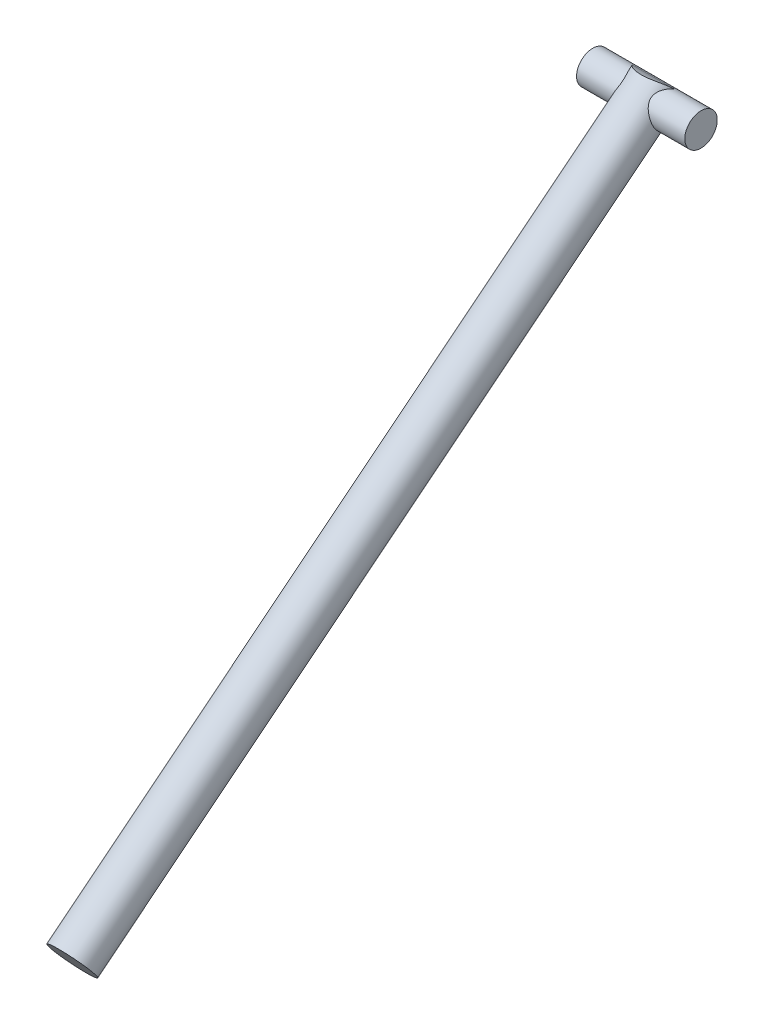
ISO-10303-21;
HEADER;
FILE_DESCRIPTION(('STEP AP214'),'2;1');
FILE_NAME('part.step','',(''),(''),'','','');
FILE_SCHEMA(('AUTOMOTIVE_DESIGN { 1 0 10303 214 1 1 1 1 }'));
ENDSEC;
DATA;
#1=APPLICATION_CONTEXT('core data for automotive mechanical design processes');
#2=APPLICATION_PROTOCOL_DEFINITION('international standard','automotive_design',2000,#1);
#3=PRODUCT_CONTEXT('',#1,'mechanical');
#4=PRODUCT('Part','Part','',(#3));
#5=PRODUCT_RELATED_PRODUCT_CATEGORY('part','',(#4));
#6=PRODUCT_DEFINITION_FORMATION('','',#4);
#7=PRODUCT_DEFINITION_CONTEXT('part definition',#1,'design');
#8=PRODUCT_DEFINITION('design','',#6,#7);
#9=PRODUCT_DEFINITION_SHAPE('','',#8);
#10=(LENGTH_UNIT() NAMED_UNIT(*) SI_UNIT(.MILLI.,.METRE.));
#11=(NAMED_UNIT(*) PLANE_ANGLE_UNIT() SI_UNIT($,.RADIAN.));
#12=(NAMED_UNIT(*) SI_UNIT($,.STERADIAN.) SOLID_ANGLE_UNIT());
#13=UNCERTAINTY_MEASURE_WITH_UNIT(LENGTH_MEASURE(1.E-05),#10,'distance_accuracy_value','');
#14=(GEOMETRIC_REPRESENTATION_CONTEXT(3) GLOBAL_UNCERTAINTY_ASSIGNED_CONTEXT((#13)) GLOBAL_UNIT_ASSIGNED_CONTEXT((#10,
#11,#12)) REPRESENTATION_CONTEXT('',''));
#15=CARTESIAN_POINT('',(0.,0.,0.));
#16=DIRECTION('',(0.,0.,1.));
#17=DIRECTION('',(1.,0.,0.));
#18=AXIS2_PLACEMENT_3D('',#15,#16,#17);
#19=CARTESIAN_POINT('',(13.5886120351,0.,0.));
#20=DIRECTION('',(1.,0.,0.));
#21=DIRECTION('',(0.,0.,-1.));
#22=AXIS2_PLACEMENT_3D('',#19,#20,#21);
#23=PLANE('',#22);
#24=CARTESIAN_POINT('',(13.5886120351,-151.390158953,1385.21245248));
#25=DIRECTION('',(1.,0.,0.));
#26=DIRECTION('',(0.,0.,-1.));
#27=AXIS2_PLACEMENT_3D('',#24,#25,#26);
#28=CIRCLE('',#27,7.49999999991);
#29=CARTESIAN_POINT('',(13.5886120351,-151.390158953,1377.71245248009));
#30=VERTEX_POINT('',#29);
#31=EDGE_CURVE('E59',#30,#30,#28,.T.);
#32=ORIENTED_EDGE('',*,*,#31,.F.);
#33=EDGE_LOOP('',(#32));
#34=FACE_BOUND('',#33,.T.);
#35=ADVANCED_FACE('F16',(#34),#23,.F.);
#36=CARTESIAN_POINT('',(-102.895065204,-160.923012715,1397.12673248));
#37=DIRECTION('',(1.,0.,0.));
#38=DIRECTION('',(0.,0.,-1.));
#39=AXIS2_PLACEMENT_3D('',#36,#37,#38);
#40=CYLINDRICAL_SURFACE('',#39,22.2586162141);
#41=DIRECTION('',(1.,0.,0.));
#42=VECTOR('',#41,1.);
#43=CARTESIAN_POINT('',(38.5886120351,-144.632807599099,1381.9585006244));
#44=LINE('',#43,#42);
#45=CARTESIAN_POINT('',(29.1292002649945,-144.632808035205,1381.95850089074));
#46=VERTEX_POINT('',#45);
#47=CARTESIAN_POINT('',(48.0480227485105,-144.63280622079,1381.95850355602));
#48=VERTEX_POINT('',#47);
#49=EDGE_CURVE('E52',#46,#48,#44,.T.);
#50=ORIENTED_EDGE('',*,*,#49,.F.);
#51=CARTESIAN_POINT('',(48.0480226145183,-144.632806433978,1381.95850359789));
#52=CARTESIAN_POINT('',(47.9556910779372,-144.447239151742,1382.15774454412));
#53=CARTESIAN_POINT('',(47.8520261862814,-144.268045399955,1382.3575746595));
#54=CARTESIAN_POINT('',(47.6232211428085,-143.922927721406,1382.75620194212));
#55=CARTESIAN_POINT('',(47.498091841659,-143.756997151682,1382.95499957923));
#56=CARTESIAN_POINT('',(47.2277618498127,-143.439102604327,1383.34910700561));
#57=CARTESIAN_POINT('',(47.0826074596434,-143.287107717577,1383.54442369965));
#58=CARTESIAN_POINT('',(46.7731590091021,-142.99675971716,1383.93000278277));
#59=CARTESIAN_POINT('',(46.6088626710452,-142.858408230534,1384.12026456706));
#60=CARTESIAN_POINT('',(46.262599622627,-142.595554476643,1384.49335339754));
#61=CARTESIAN_POINT('',(46.0806646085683,-142.471028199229,1384.67619297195));
#62=CARTESIAN_POINT('',(45.6999381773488,-142.235324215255,1385.03284957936));
#63=CARTESIAN_POINT('',(45.5011410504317,-142.124151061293,1385.20666352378));
#64=CARTESIAN_POINT('',(45.087713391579,-141.914872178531,1385.54330023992));
#65=CARTESIAN_POINT('',(44.8730723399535,-141.816775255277,1385.70611556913));
#66=CARTESIAN_POINT('',(44.429195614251,-141.63343160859,1386.01858778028));
#67=CARTESIAN_POINT('',(44.1999592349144,-141.548185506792,1386.16824402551));
#68=CARTESIAN_POINT('',(43.7198778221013,-141.387490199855,1386.45725986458));
#69=CARTESIAN_POINT('',(43.4685584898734,-141.312484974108,1386.59608014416));
#70=CARTESIAN_POINT('',(42.9531614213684,-141.175619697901,1386.8550278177));
#71=CARTESIAN_POINT('',(42.6890891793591,-141.113754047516,1386.97516316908));
#72=CARTESIAN_POINT('',(42.1499237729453,-141.002878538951,1387.19449420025));
#73=CARTESIAN_POINT('',(41.8748363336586,-140.953862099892,1387.29370059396));
#74=CARTESIAN_POINT('',(41.3155265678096,-140.868426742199,1387.46913860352));
#75=CARTESIAN_POINT('',(41.0313051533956,-140.832006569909,1387.54537250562));
#76=CARTESIAN_POINT('',(40.4753424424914,-140.773624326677,1387.66880009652));
#77=CARTESIAN_POINT('',(40.204041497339,-140.750856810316,1387.71759774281));
#78=CARTESIAN_POINT('',(39.6576450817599,-140.716058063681,1387.79256404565));
#79=CARTESIAN_POINT('',(39.3825497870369,-140.704026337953,1387.81873374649));
#80=CARTESIAN_POINT('',(38.8309879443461,-140.690657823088,1387.84782795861));
#81=CARTESIAN_POINT('',(38.5545220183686,-140.689316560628,1387.85076219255));
#82=CARTESIAN_POINT('',(38.0024887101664,-140.697312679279,1387.83333974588));
#83=CARTESIAN_POINT('',(37.7269212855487,-140.706649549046,1387.81298418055));
#84=CARTESIAN_POINT('',(37.2019839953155,-140.734801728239,1387.75213190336));
#85=CARTESIAN_POINT('',(36.9523528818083,-140.752757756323,1387.71346472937));
#86=CARTESIAN_POINT('',(36.457394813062,-140.797723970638,1387.61770806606));
#87=CARTESIAN_POINT('',(36.2120693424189,-140.824737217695,1387.56061234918));
#88=CARTESIAN_POINT('',(35.7274042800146,-140.887894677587,1387.42903402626));
#89=CARTESIAN_POINT('',(35.4880633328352,-140.924036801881,1387.35455539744));
#90=CARTESIAN_POINT('',(35.0165754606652,-141.005587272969,1387.18939698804));
#91=CARTESIAN_POINT('',(34.7844312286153,-141.050999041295,1387.09871122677));
#92=CARTESIAN_POINT('',(34.3197625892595,-141.153176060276,1386.89870023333));
#93=CARTESIAN_POINT('',(34.0875726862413,-141.210313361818,1386.78878845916));
#94=CARTESIAN_POINT('',(33.6333867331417,-141.334966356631,1386.5545026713));
#95=CARTESIAN_POINT('',(33.4113951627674,-141.402486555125,1386.43012238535));
#96=CARTESIAN_POINT('',(32.9786253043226,-141.548148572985,1386.16849100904));
#97=CARTESIAN_POINT('',(32.7678523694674,-141.626295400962,1386.03123385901));
#98=CARTESIAN_POINT('',(32.3585557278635,-141.793426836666,1385.74550522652));
#99=CARTESIAN_POINT('',(32.160032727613,-141.882412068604,1385.59703309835));
#100=CARTESIAN_POINT('',(31.7569951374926,-142.080874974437,1385.27519078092));
#101=CARTESIAN_POINT('',(31.5538522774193,-142.191510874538,1385.10081348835));
#102=CARTESIAN_POINT('',(31.1646646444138,-142.426408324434,1384.74256975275));
#103=CARTESIAN_POINT('',(30.9786145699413,-142.550665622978,1384.5587062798));
#104=CARTESIAN_POINT('',(30.6248661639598,-142.812906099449,1384.18369138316));
#105=CARTESIAN_POINT('',(30.4571497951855,-142.950875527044,1383.99254737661));
#106=CARTESIAN_POINT('',(30.1410978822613,-143.240646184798,1383.60495487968));
#107=CARTESIAN_POINT('',(29.9927547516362,-143.392441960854,1383.40850850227));
#108=CARTESIAN_POINT('',(29.7104974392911,-143.716791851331,1383.00363103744));
#109=CARTESIAN_POINT('',(29.5775023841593,-143.889964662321,1382.79505237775));
#110=CARTESIAN_POINT('',(29.3352638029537,-144.250698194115,1382.3769319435));
#111=CARTESIAN_POINT('',(29.2260003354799,-144.438246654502,1382.16739112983));
#112=CARTESIAN_POINT('',(29.1292002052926,-144.632808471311,1381.95850115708));
#113=B_SPLINE_CURVE_WITH_KNOTS('',3,(#51,#52,#53,#54,#55,#56,#57,#58,#59,#60,#61,#62,#63,#64,
#65,#66,#67,#68,#69,#70,#71,#72,#73,#74,#75,#76,#77,#78,#79,#80,#81,#82,#83,#84,#85,#86,#87,#88,
#89,#90,#91,#92,#93,#94,#95,#96,#97,#98,#99,#100,#101,#102,#103,#104,#105,#106,#107,#108,#109,
#110,#111,#112),.UNSPECIFIED.,.F.,.F.,(4,2,2,2,2,2,2,2,2,2,2,2,2,2,2,2,2,2,2,2,2,2,2,2,2,2,2,2,
2,2,4),(0.,0.862119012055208,1.72380348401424,2.5835280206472,3.44335495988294,4.3016644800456,
5.16026580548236,6.0194424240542,6.8786605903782,7.76776922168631,8.65649816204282,
9.54477103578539,10.4329554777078,11.2616090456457,12.090224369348,12.9184929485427,
13.7467218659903,14.505588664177,15.2647121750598,16.0236621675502,16.7828928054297,
17.5715719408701,18.3605942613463,19.1499897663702,19.9394307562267,20.8074791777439,
21.6752574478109,22.5421741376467,23.4087503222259,24.3133631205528,25.2172128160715),.UNSPECIFIED.);
#114=EDGE_CURVE('E19',#48,#46,#113,.T.);
#115=ORIENTED_EDGE('',*,*,#114,.F.);
#116=EDGE_LOOP('',(#50,#115));
#117=FACE_BOUND('',#116,.T.);
#118=ADVANCED_FACE('F57',(#117),#40,.T.);
#119=CARTESIAN_POINT('',(63.5886120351,0.,0.));
#120=DIRECTION('',(1.,0.,0.));
#121=DIRECTION('',(0.,0.,-1.));
#122=AXIS2_PLACEMENT_3D('',#119,#120,#121);
#123=PLANE('',#122);
#124=CARTESIAN_POINT('',(63.5886120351,-151.390158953,1385.21245248));
#125=DIRECTION('',(1.,0.,0.));
#126=DIRECTION('',(0.,0.,-1.));
#127=AXIS2_PLACEMENT_3D('',#124,#125,#126);
#128=CIRCLE('',#127,7.49999999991);
#129=CARTESIAN_POINT('',(63.5886120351,-151.390158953,1377.71245248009));
#130=VERTEX_POINT('',#129);
#131=EDGE_CURVE('E58',#130,#130,#128,.F.);
#132=ORIENTED_EDGE('',*,*,#131,.F.);
#133=EDGE_LOOP('',(#132));
#134=FACE_BOUND('',#133,.T.);
#135=ADVANCED_FACE('F91',(#134),#123,.T.);
#136=CARTESIAN_POINT('',(0.,-947.241267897,1183.87399765));
#137=DIRECTION('',(0.,-0.624752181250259,0.780823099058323));
#138=DIRECTION('',(0.,-0.780823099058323,-0.624752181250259));
#139=AXIS2_PLACEMENT_3D('',#136,#137,#138);
#140=PLANE('',#139);
#141=CARTESIAN_POINT('',(38.5886120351,-363.805900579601,1650.69230615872));
#142=DIRECTION('',(0.,-0.624752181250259,0.780823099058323));
#143=DIRECTION('',(0.,-0.780823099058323,-0.624752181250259));
#144=AXIS2_PLACEMENT_3D('',#141,#142,#143);
#145=CIRCLE('',#144,10.);
#146=CARTESIAN_POINT('',(38.5886120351,-371.614131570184,1644.44478434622));
#147=VERTEX_POINT('',#146);
#148=EDGE_CURVE('E53',#147,#147,#145,.F.);
#149=ORIENTED_EDGE('',*,*,#148,.F.);
#150=EDGE_LOOP('',(#149));
#151=FACE_BOUND('',#150,.T.);
#152=ADVANCED_FACE('F88',(#151),#140,.T.);
#153=CARTESIAN_POINT('',(-102.895065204,-160.923012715,1397.12673248));
#154=DIRECTION('',(1.,0.,0.));
#155=DIRECTION('',(0.,0.,-1.));
#156=AXIS2_PLACEMENT_3D('',#153,#154,#155);
#157=CYLINDRICAL_SURFACE('',#156,22.2586162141);
#158=DIRECTION('',(1.,0.,0.));
#159=VECTOR('',#158,1.);
#160=CARTESIAN_POINT('',(38.5886120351,-149.697824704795,1377.90587976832));
#161=LINE('',#160,#159);
#162=CARTESIAN_POINT('',(48.0480233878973,-149.697824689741,1377.90587977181));
#163=VERTEX_POINT('',#162);
#164=CARTESIAN_POINT('',(29.1292011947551,-149.697826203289,1377.90587927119));
#165=VERTEX_POINT('',#164);
#166=EDGE_CURVE('E37',#163,#165,#161,.F.);
#167=ORIENTED_EDGE('',*,*,#166,.F.);
#168=CARTESIAN_POINT('',(29.1292019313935,-149.69782776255,1377.90587903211));
#169=CARTESIAN_POINT('',(29.2215334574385,-149.932923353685,1377.76853915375));
#170=CARTESIAN_POINT('',(29.325198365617,-150.167195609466,1377.63754683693));
#171=CARTESIAN_POINT('',(29.5540034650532,-150.631821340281,1377.38828223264));
#172=CARTESIAN_POINT('',(29.6791328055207,-150.862176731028,1377.27000356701));
#173=CARTESIAN_POINT('',(29.9494628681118,-151.316420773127,1377.04630749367));
#174=CARTESIAN_POINT('',(30.0946172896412,-151.540322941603,1376.94086144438));
#175=CARTESIAN_POINT('',(30.4040658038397,-151.980203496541,1376.74217007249));
#176=CARTESIAN_POINT('',(30.5683621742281,-152.196180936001,1376.64892620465));
#177=CARTESIAN_POINT('',(30.9146252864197,-152.617844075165,1376.4743193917));
#178=CARTESIAN_POINT('',(31.0965603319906,-152.82354726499,1376.39293576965));
#179=CARTESIAN_POINT('',(31.4772868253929,-153.223222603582,1376.2412126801));
#180=CARTESIAN_POINT('',(31.6760839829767,-153.417190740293,1376.17087697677));
#181=CARTESIAN_POINT('',(32.0895117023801,-153.791536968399,1376.04054356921));
#182=CARTESIAN_POINT('',(32.3041527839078,-153.971905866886,1375.9805528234));
#183=CARTESIAN_POINT('',(32.748029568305,-154.316986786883,1375.87022196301));
#184=CARTESIAN_POINT('',(32.9772659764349,-154.48169805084,1375.81988231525));
#185=CARTESIAN_POINT('',(33.4573474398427,-154.79892558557,1375.72650251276));
#186=CARTESIAN_POINT('',(33.7086667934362,-154.950818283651,1375.68377721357));
#187=CARTESIAN_POINT('',(34.224063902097,-155.233482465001,1375.60705094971));
#188=CARTESIAN_POINT('',(34.4881361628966,-155.364262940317,1375.57304626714));
#189=CARTESIAN_POINT('',(35.0273016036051,-155.602574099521,1375.51298602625));
#190=CARTESIAN_POINT('',(35.302389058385,-155.710116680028,1375.48692639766));
#191=CARTESIAN_POINT('',(35.8616988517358,-155.900023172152,1375.44205784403));
#192=CARTESIAN_POINT('',(36.1459202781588,-155.982389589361,1375.4232481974));
#193=CARTESIAN_POINT('',(36.701882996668,-156.115617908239,1375.39336429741));
#194=CARTESIAN_POINT('',(36.9731839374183,-156.168221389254,1375.3818560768));
#195=CARTESIAN_POINT('',(37.5195803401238,-156.248995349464,1375.36435029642));
#196=CARTESIAN_POINT('',(37.7946756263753,-156.277166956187,1375.35835248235));
#197=CARTESIAN_POINT('',(38.3462374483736,-156.308485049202,1375.35169199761));
#198=CARTESIAN_POINT('',(38.6227033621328,-156.31164200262,1375.35102709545));
#199=CARTESIAN_POINT('',(39.1747366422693,-156.292889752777,1375.35500650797));
#200=CARTESIAN_POINT('',(39.4503040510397,-156.270981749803,1375.35965056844));
#201=CARTESIAN_POINT('',(39.9752413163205,-156.205435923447,1375.37376789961));
#202=CARTESIAN_POINT('',(40.2248724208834,-156.163771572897,1375.38280416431));
#203=CARTESIAN_POINT('',(40.7198304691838,-156.060483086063,1375.40566901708));
#204=CARTESIAN_POINT('',(40.9651559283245,-155.998852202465,1375.4194992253));
#205=CARTESIAN_POINT('',(41.4498209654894,-155.856624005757,1375.45225404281));
#206=CARTESIAN_POINT('',(41.6891618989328,-155.776031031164,1375.47117748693));
#207=CARTESIAN_POINT('',(42.1606497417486,-155.59700583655,1375.514510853));
#208=CARTESIAN_POINT('',(42.3927939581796,-155.498567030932,1375.53892280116));
#209=CARTESIAN_POINT('',(42.8574625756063,-155.281013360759,1375.59473470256));
#210=CARTESIAN_POINT('',(43.0896524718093,-155.161244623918,1375.62636897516));
#211=CARTESIAN_POINT('',(43.5438384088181,-154.90532048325,1375.69659054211));
#212=CARTESIAN_POINT('',(43.7658299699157,-154.769157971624,1375.735180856));
#213=CARTESIAN_POINT('',(44.1985998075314,-154.481945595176,1375.81990092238));
#214=CARTESIAN_POINT('',(44.4093727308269,-154.330888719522,1375.86603423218));
#215=CARTESIAN_POINT('',(44.8186693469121,-154.015456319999,1375.96641456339));
#216=CARTESIAN_POINT('',(45.017192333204,-153.851080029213,1376.02066205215));
#217=CARTESIAN_POINT('',(45.4202298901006,-153.493540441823,1376.14368844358));
#218=CARTESIAN_POINT('',(45.623372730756,-153.299140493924,1376.21337643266));
#219=CARTESIAN_POINT('',(46.0125603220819,-152.898093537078,1376.36396453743));
#220=CARTESIAN_POINT('',(46.1986103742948,-152.691450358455,1376.44486115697));
#221=CARTESIAN_POINT('',(46.5523587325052,-152.268042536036,1376.61844718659));
#222=CARTESIAN_POINT('',(46.7200750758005,-152.051288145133,1376.71112480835));
#223=CARTESIAN_POINT('',(47.0361269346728,-151.60956981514,1376.90881129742));
#224=CARTESIAN_POINT('',(47.184470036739,-151.384609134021,1377.01381530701));
#225=CARTESIAN_POINT('',(47.4667270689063,-150.918441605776,1377.24144677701));
#226=CARTESIAN_POINT('',(47.599721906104,-150.67695506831,1377.36464546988));
#227=CARTESIAN_POINT('',(47.8419601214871,-150.189886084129,1377.62486898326));
#228=CARTESIAN_POINT('',(47.9512234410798,-149.944307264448,1377.76188205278));
#229=CARTESIAN_POINT('',(48.0480234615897,-149.697824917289,1377.90588040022));
#230=B_SPLINE_CURVE_WITH_KNOTS('',3,(#168,#169,#170,#171,#172,#173,#174,#175,#176,#177,#178,
#179,#180,#181,#182,#183,#184,#185,#186,#187,#188,#189,#190,#191,#192,#193,#194,#195,#196,#197,
#198,#199,#200,#201,#202,#203,#204,#205,#206,#207,#208,#209,#210,#211,#212,#213,#214,#215,#216,
#217,#218,#219,#220,#221,#222,#223,#224,#225,#226,#227,#228,#229),.UNSPECIFIED.,.F.,.F.,(4,2,2,
2,2,2,2,2,2,2,2,2,2,2,2,2,2,2,2,2,2,2,2,2,2,2,2,2,2,2,4),(0.,0.862119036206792,1.72380352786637,
2.58352808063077,3.44335503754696,4.30166457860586,5.16026592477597,6.01944256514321,
6.87866075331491,7.76776938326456,8.65649832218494,9.5447711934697,10.4329556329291,
11.2616091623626,12.0902244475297,12.9184929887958,13.746721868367,14.505588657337,
15.2647121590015,16.0236621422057,16.7828927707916,17.5715719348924,18.3605942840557,
19.1499898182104,19.9394308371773,20.8074792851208,21.6752575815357,22.5421742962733,
23.4087505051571,24.3133619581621,25.2172103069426),.UNSPECIFIED.);
#231=EDGE_CURVE('E29',#165,#163,#230,.T.);
#232=ORIENTED_EDGE('',*,*,#231,.F.);
#233=EDGE_LOOP('',(#167,#232));
#234=FACE_BOUND('',#233,.T.);
#235=ADVANCED_FACE('F90',(#234),#157,.T.);
#236=CARTESIAN_POINT('',(38.5886120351,-151.390158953,1385.21245248));
#237=DIRECTION('',(1.,0.,0.));
#238=DIRECTION('',(0.,0.,-1.));
#239=AXIS2_PLACEMENT_3D('',#236,#237,#238);
#240=CYLINDRICAL_SURFACE('',#239,7.49999999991);
#241=ORIENTED_EDGE('',*,*,#31,.T.);
#242=EDGE_LOOP('',(#241));
#243=FACE_BOUND('',#242,.T.);
#244=ORIENTED_EDGE('',*,*,#131,.T.);
#245=EDGE_LOOP('',(#244));
#246=FACE_BOUND('',#245,.T.);
#247=ORIENTED_EDGE('',*,*,#49,.T.);
#248=CARTESIAN_POINT('',(48.048023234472,-149.69782467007,1377.90587997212));
#249=CARTESIAN_POINT('',(47.9785787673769,-149.916745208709,1377.85517596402));
#250=CARTESIAN_POINT('',(47.9038545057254,-150.136210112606,1377.81470623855));
#251=CARTESIAN_POINT('',(47.7459518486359,-150.574605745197,1377.75364591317));
#252=CARTESIAN_POINT('',(47.6627829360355,-150.793536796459,1377.73303328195));
#253=CARTESIAN_POINT('',(47.4900409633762,-151.229462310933,1377.71100160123));
#254=CARTESIAN_POINT('',(47.4004760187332,-151.446458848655,1377.70955864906));
#255=CARTESIAN_POINT('',(47.2168529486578,-151.877918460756,1377.72521624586));
#256=CARTESIAN_POINT('',(47.1227935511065,-152.092380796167,1377.74232207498));
#257=CARTESIAN_POINT('',(46.9326952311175,-152.517095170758,1377.79452788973));
#258=CARTESIAN_POINT('',(46.8366663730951,-152.727361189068,1377.82955140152));
#259=CARTESIAN_POINT('',(46.6444334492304,-153.144089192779,1377.9173121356));
#260=CARTESIAN_POINT('',(46.5482293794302,-153.350551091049,1377.9700497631));
#261=CARTESIAN_POINT('',(46.3580400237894,-153.759282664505,1378.09326431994));
#262=CARTESIAN_POINT('',(46.2640557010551,-153.96155051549,1378.16374880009));
#263=CARTESIAN_POINT('',(46.0811685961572,-154.36125256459,1378.32268931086));
#264=CARTESIAN_POINT('',(45.9922643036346,-154.558688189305,1378.41113996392));
#265=CARTESIAN_POINT('',(45.8458496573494,-154.895161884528,1378.57994708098));
#266=CARTESIAN_POINT('',(45.7863654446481,-155.035512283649,1378.65599007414));
#267=CARTESIAN_POINT('',(45.673329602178,-155.312882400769,1378.81807653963));
#268=CARTESIAN_POINT('',(45.619779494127,-155.44990125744,1378.90412256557));
#269=CARTESIAN_POINT('',(45.5203799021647,-155.719665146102,1379.08613283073));
#270=CARTESIAN_POINT('',(45.4745143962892,-155.852418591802,1379.18207574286));
#271=CARTESIAN_POINT('',(45.392090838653,-156.113049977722,1379.3839503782));
#272=CARTESIAN_POINT('',(45.3555267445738,-156.240931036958,1379.48987555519));
#273=CARTESIAN_POINT('',(45.2981632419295,-156.471341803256,1379.69416882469));
#274=CARTESIAN_POINT('',(45.2757952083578,-156.574717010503,1379.79114294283));
#275=CARTESIAN_POINT('',(45.2396681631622,-156.776500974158,1379.9915784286));
#276=CARTESIAN_POINT('',(45.2259052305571,-156.874911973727,1380.09503681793));
#277=CARTESIAN_POINT('',(45.2075381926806,-157.065986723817,1380.30782062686));
#278=CARTESIAN_POINT('',(45.2029295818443,-157.158653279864,1380.41714313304));
#279=CARTESIAN_POINT('',(45.2030522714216,-157.337563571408,1380.64092074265));
#280=CARTESIAN_POINT('',(45.2077837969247,-157.423807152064,1380.75537596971));
#281=CARTESIAN_POINT('',(45.226368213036,-157.589077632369,1380.98826711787));
#282=CARTESIAN_POINT('',(45.2401998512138,-157.668120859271,1381.10669315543));
#283=CARTESIAN_POINT('',(45.2763965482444,-157.818819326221,1381.34690386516));
#284=CARTESIAN_POINT('',(45.298764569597,-157.890471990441,1381.46868968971));
#285=CARTESIAN_POINT('',(45.3775755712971,-158.094174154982,1381.83825113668));
#286=CARTESIAN_POINT('',(45.4457027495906,-158.214791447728,1382.08998049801));
#287=CARTESIAN_POINT('',(45.583385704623,-158.396853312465,1382.52977369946));
#288=CARTESIAN_POINT('',(45.6475997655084,-158.465483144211,1382.71669596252));
#289=CARTESIAN_POINT('',(45.7851908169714,-158.58696425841,1383.09233209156));
#290=CARTESIAN_POINT('',(45.8585692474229,-158.639813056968,1383.28104623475));
#291=CARTESIAN_POINT('',(46.0117080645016,-158.730181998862,1383.65941893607));
#292=CARTESIAN_POINT('',(46.0914665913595,-158.767706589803,1383.84907720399));
#293=CARTESIAN_POINT('',(46.2550001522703,-158.827872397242,1384.22890655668));
#294=CARTESIAN_POINT('',(46.3387731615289,-158.850521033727,1384.4190773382));
#295=CARTESIAN_POINT('',(46.4681210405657,-158.873941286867,1384.70939043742));
#296=CARTESIAN_POINT('',(46.5129712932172,-158.87999409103,1384.80946027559));
#297=CARTESIAN_POINT('',(46.6029570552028,-158.888083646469,1385.00959385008));
#298=CARTESIAN_POINT('',(46.6480924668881,-158.890121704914,1385.10965757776));
#299=CARTESIAN_POINT('',(46.7881613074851,-158.890235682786,1385.41999312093));
#300=CARTESIAN_POINT('',(46.8831907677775,-158.881475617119,1385.63026583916));
#301=CARTESIAN_POINT('',(47.071346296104,-158.846194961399,1386.05028560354));
#302=CARTESIAN_POINT('',(47.1644713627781,-158.819665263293,1386.26003232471));
#303=CARTESIAN_POINT('',(47.3469132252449,-158.748538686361,1386.67852066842));
#304=CARTESIAN_POINT('',(47.436224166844,-158.703915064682,1386.88726033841));
#305=CARTESIAN_POINT('',(47.6089644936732,-158.596241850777,1387.3025184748));
#306=CARTESIAN_POINT('',(47.6923923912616,-158.533187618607,1387.50903636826));
#307=CARTESIAN_POINT('',(47.8386617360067,-158.399943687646,1387.88568578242));
#308=CARTESIAN_POINT('',(47.9026600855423,-158.332515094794,1388.05634655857));
#309=CARTESIAN_POINT('',(48.0239909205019,-158.184310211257,1388.39420064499));
#310=CARTESIAN_POINT('',(48.0813245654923,-158.10353624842,1388.56139455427));
#311=CARTESIAN_POINT('',(48.188143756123,-157.928757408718,1388.89096647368));
#312=CARTESIAN_POINT('',(48.2376416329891,-157.834773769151,1389.05335171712));
#313=CARTESIAN_POINT('',(48.3278509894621,-157.633643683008,1389.37231132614));
#314=CARTESIAN_POINT('',(48.368563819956,-157.526499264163,1389.52888658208));
#315=CARTESIAN_POINT('',(48.4343751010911,-157.31813283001,1389.80967648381));
#316=CARTESIAN_POINT('',(48.4609402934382,-157.218834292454,1389.93497855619));
#317=CARTESIAN_POINT('',(48.5068339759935,-157.011718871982,1390.17972064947));
#318=CARTESIAN_POINT('',(48.5261634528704,-156.903903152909,1390.29916146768));
#319=CARTESIAN_POINT('',(48.5572418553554,-156.680239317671,1390.53138498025));
#320=CARTESIAN_POINT('',(48.5689889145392,-156.5643892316,1390.64416602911));
#321=CARTESIAN_POINT('',(48.5846730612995,-156.325387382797,1390.86220294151));
#322=CARTESIAN_POINT('',(48.5886127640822,-156.202238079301,1390.96746131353));
#323=CARTESIAN_POINT('',(48.5886112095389,-155.932611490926,1391.18319285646));
#324=CARTESIAN_POINT('',(48.5835566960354,-155.785205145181,1391.29250939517));
#325=CARTESIAN_POINT('',(48.5634598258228,-155.483239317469,1391.49976018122));
#326=CARTESIAN_POINT('',(48.5484165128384,-155.328679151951,1391.59769333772));
#327=CARTESIAN_POINT('',(48.5086910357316,-155.013671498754,1391.78158002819));
#328=CARTESIAN_POINT('',(48.4840034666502,-154.853220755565,1391.86752680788));
#329=CARTESIAN_POINT('',(48.4255566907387,-154.527867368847,1392.02696732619));
#330=CARTESIAN_POINT('',(48.3917975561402,-154.362964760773,1392.10046116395));
#331=CARTESIAN_POINT('',(48.3161432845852,-154.030915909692,1392.23443711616));
#332=CARTESIAN_POINT('',(48.2742951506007,-153.863787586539,1392.29499033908));
#333=CARTESIAN_POINT('',(48.1831644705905,-153.527492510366,1392.4036326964));
#334=CARTESIAN_POINT('',(48.1338789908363,-153.358324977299,1392.45171689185));
#335=CARTESIAN_POINT('',(47.9762273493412,-152.849463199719,1392.57739200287));
#336=CARTESIAN_POINT('',(47.8579950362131,-152.508108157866,1392.63652532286));
#337=CARTESIAN_POINT('',(47.5910773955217,-151.796398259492,1392.71077558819));
#338=CARTESIAN_POINT('',(47.4405873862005,-151.426279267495,1392.72131887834));
#339=CARTESIAN_POINT('',(47.1269284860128,-150.693248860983,1392.68902425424));
#340=CARTESIAN_POINT('',(46.9637411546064,-150.330348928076,1392.64610728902));
#341=CARTESIAN_POINT('',(46.7009182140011,-149.757974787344,1392.53597115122));
#342=CARTESIAN_POINT('',(46.6018361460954,-149.544917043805,1392.4852203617));
#343=CARTESIAN_POINT('',(46.4055371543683,-149.123134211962,1392.36498400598));
#344=CARTESIAN_POINT('',(46.3083208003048,-148.914410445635,1392.2954928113));
#345=CARTESIAN_POINT('',(46.1188597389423,-148.502137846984,1392.13762315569));
#346=CARTESIAN_POINT('',(46.0266101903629,-148.298584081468,1392.04926351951));
#347=CARTESIAN_POINT('',(45.8505631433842,-147.897363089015,1391.8532548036));
#348=CARTESIAN_POINT('',(45.7667608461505,-147.699692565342,1391.74561677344));
#349=CARTESIAN_POINT('',(45.5874707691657,-147.250470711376,1391.47356774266));
#350=CARTESIAN_POINT('',(45.4964835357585,-147.001331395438,1391.30191862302));
#351=CARTESIAN_POINT('',(45.3844376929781,-146.640598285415,1391.01891813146));
#352=CARTESIAN_POINT('',(45.3511736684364,-146.522580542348,1390.92039398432));
#353=CARTESIAN_POINT('',(45.2940226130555,-146.291622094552,1390.71506611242));
#354=CARTESIAN_POINT('',(45.2701307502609,-146.178678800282,1390.6082666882));
#355=CARTESIAN_POINT('',(45.2326075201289,-145.957781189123,1390.38585256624));
#356=CARTESIAN_POINT('',(45.2190751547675,-145.849884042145,1390.27016416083));
#357=CARTESIAN_POINT('',(45.2033228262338,-145.641283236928,1390.03173822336));
#358=CARTESIAN_POINT('',(45.2011025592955,-145.540579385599,1389.90900088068));
#359=CARTESIAN_POINT('',(45.2080969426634,-145.347277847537,1389.65753298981));
#360=CARTESIAN_POINT('',(45.2173160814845,-145.254683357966,1389.52880010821));
#361=CARTESIAN_POINT('',(45.2467041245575,-145.078378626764,1389.26663769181));
#362=CARTESIAN_POINT('',(45.2668731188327,-144.994668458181,1389.13320811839));
#363=CARTESIAN_POINT('',(45.3370270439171,-144.774502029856,1388.75661626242));
#364=CARTESIAN_POINT('',(45.3979898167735,-144.64818288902,1388.5094838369));
#365=CARTESIAN_POINT('',(45.544335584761,-144.425698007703,1388.00915437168));
#366=CARTESIAN_POINT('',(45.6297364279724,-144.329554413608,1387.7559530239));
#367=CARTESIAN_POINT('',(45.7927089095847,-144.187564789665,1387.31287393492));
#368=CARTESIAN_POINT('',(45.8665380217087,-144.135140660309,1387.12365785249));
#369=CARTESIAN_POINT('',(46.0205819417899,-144.04563820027,1386.74413247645));
#370=CARTESIAN_POINT('',(46.1007989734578,-144.008565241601,1386.55382282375));
#371=CARTESIAN_POINT('',(46.2653903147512,-143.949314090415,1386.17223725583));
#372=CARTESIAN_POINT('',(46.3497728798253,-143.92716686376,1385.98096015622));
#373=CARTESIAN_POINT('',(46.5204931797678,-143.897625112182,1385.5981736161));
#374=CARTESIAN_POINT('',(46.60683074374,-143.890229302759,1385.40666419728));
#375=CARTESIAN_POINT('',(46.789356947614,-143.890081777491,1385.00226540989));
#376=CARTESIAN_POINT('',(46.8855663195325,-143.899062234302,1384.78938280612));
#377=CARTESIAN_POINT('',(47.0759914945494,-143.935227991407,1384.36420135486));
#378=CARTESIAN_POINT('',(47.1702068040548,-143.962417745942,1384.15190266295));
#379=CARTESIAN_POINT('',(47.3542704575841,-144.035152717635,1383.7293084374));
#380=CARTESIAN_POINT('',(47.4441308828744,-144.08064345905,1383.5190088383));
#381=CARTESIAN_POINT('',(47.6177415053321,-144.190303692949,1383.10087833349));
#382=CARTESIAN_POINT('',(47.7014957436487,-144.254460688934,1382.89304587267));
#383=CARTESIAN_POINT('',(47.8288327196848,-144.372090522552,1382.56409828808));
#384=CARTESIAN_POINT('',(47.8750067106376,-144.419456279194,1382.44177639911));
#385=CARTESIAN_POINT('',(47.964073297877,-144.521004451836,1382.19880894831));
#386=CARTESIAN_POINT('',(48.0069664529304,-144.575185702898,1382.0781631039));
#387=CARTESIAN_POINT('',(48.048022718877,-144.632806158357,1381.95850361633));
#388=B_SPLINE_CURVE_WITH_KNOTS('',3,(#248,#249,#250,#251,#252,#253,#254,#255,#256,#257,#258,
#259,#260,#261,#262,#263,#264,#265,#266,#267,#268,#269,#270,#271,#272,#273,#274,#275,#276,#277,
#278,#279,#280,#281,#282,#283,#284,#285,#286,#287,#288,#289,#290,#291,#292,#293,#294,#295,#296,
#297,#298,#299,#300,#301,#302,#303,#304,#305,#306,#307,#308,#309,#310,#311,#312,#313,#314,#315,
#316,#317,#318,#319,#320,#321,#322,#323,#324,#325,#326,#327,#328,#329,#330,#331,#332,#333,#334,
#335,#336,#337,#338,#339,#340,#341,#342,#343,#344,#345,#346,#347,#348,#349,#350,#351,#352,#353,
#354,#355,#356,#357,#358,#359,#360,#361,#362,#363,#364,#365,#366,#367,#368,#369,#370,#371,#372,
#373,#374,#375,#376,#377,#378,#379,#380,#381,#382,#383,#384,#385,#386,#387),.UNSPECIFIED.,.F.,
.F.,(4,2,2,2,2,2,2,2,2,2,2,2,2,2,2,2,2,2,2,2,2,2,2,2,2,2,2,2,2,2,2,2,2,2,2,2,2,2,2,2,2,2,2,2,2,
2,2,2,2,2,2,2,2,2,2,2,2,2,2,2,2,2,2,2,2,2,2,2,2,4),(0.,0.705119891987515,1.40945655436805,
2.11291489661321,2.81657354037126,3.51725367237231,4.21794983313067,4.9189446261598,
5.61972990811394,6.13040742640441,6.64121559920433,7.15094514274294,7.66034270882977,
8.0903725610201,8.52020632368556,8.94982847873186,9.37946098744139,9.80809367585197,
10.236875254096,11.0953489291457,11.7222701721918,12.3492900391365,12.9761277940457,
13.6026526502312,13.9320717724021,14.2613836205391,14.9533899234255,15.6457511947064,
16.3391395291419,17.0327025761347,17.6151624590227,18.1975208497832,18.778953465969,
19.3602966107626,19.8460413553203,20.331719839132,20.8175178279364,21.3031530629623,
21.8531274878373,22.4031545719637,22.9534903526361,23.5038217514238,24.0510465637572,
24.5984878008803,25.6923845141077,26.8873906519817,28.0841659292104,28.8046679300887,
29.5253865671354,30.2453894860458,30.9649810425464,31.9088859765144,32.3802979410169,
32.8514665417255,33.3270835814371,33.8026878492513,34.2784787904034,34.7542736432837,
35.6033163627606,36.4529807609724,37.0816157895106,37.7104706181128,38.3406261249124,
38.9707267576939,39.6713701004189,40.3721848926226,41.0709288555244,41.7692061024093,
42.1861946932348,42.6031121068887),.UNSPECIFIED.);
#389=EDGE_CURVE('E11',#163,#48,#388,.T.);
#390=ORIENTED_EDGE('',*,*,#389,.F.);
#391=ORIENTED_EDGE('',*,*,#166,.T.);
#392=CARTESIAN_POINT('',(29.1292003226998,-144.632807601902,1381.95850061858));
#393=CARTESIAN_POINT('',(29.1984539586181,-144.535581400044,1382.16040953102));
#394=CARTESIAN_POINT('',(29.2729600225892,-144.448166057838,1382.36508323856));
#395=CARTESIAN_POINT('',(29.4304286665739,-144.292699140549,1382.77836664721));
#396=CARTESIAN_POINT('',(29.5133864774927,-144.224636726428,1382.98697407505));
#397=CARTESIAN_POINT('',(29.6849909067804,-144.108053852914,1383.40480947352));
#398=CARTESIAN_POINT('',(29.7735774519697,-144.059357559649,1383.61401363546));
#399=CARTESIAN_POINT('',(29.9551405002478,-143.980257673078,1384.03389930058));
#400=CARTESIAN_POINT('',(30.048115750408,-143.949848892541,1384.24458036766));
#401=CARTESIAN_POINT('',(30.1986366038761,-143.915630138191,1384.58194175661));
#402=CARTESIAN_POINT('',(30.2554280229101,-143.906043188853,1384.70840485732));
#403=CARTESIAN_POINT('',(30.369479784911,-143.893281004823,1384.96163096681));
#404=CARTESIAN_POINT('',(30.4267406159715,-143.890113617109,1385.08839415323));
#405=CARTESIAN_POINT('',(30.5714921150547,-143.890229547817,1385.40909562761));
#406=CARTESIAN_POINT('',(30.6589381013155,-143.897815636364,1385.60306879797));
#407=CARTESIAN_POINT('',(30.8318235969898,-143.928122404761,1385.99081985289));
#408=CARTESIAN_POINT('',(30.9172622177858,-143.950849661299,1386.18459761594));
#409=CARTESIAN_POINT('',(31.0840555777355,-144.011764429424,1386.5717561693));
#410=CARTESIAN_POINT('',(31.1654063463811,-144.049966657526,1386.76513640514));
#411=CARTESIAN_POINT('',(31.3213886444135,-144.142224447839,1387.15069341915));
#412=CARTESIAN_POINT('',(31.3960226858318,-144.196274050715,1387.34287062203));
#413=CARTESIAN_POINT('',(31.5715965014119,-144.352858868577,1387.8237499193));
#414=CARTESIAN_POINT('',(31.6664262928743,-144.466048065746,1388.11146734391));
#415=CARTESIAN_POINT('',(31.7834816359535,-144.664873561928,1388.53584633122));
#416=CARTESIAN_POINT('',(31.8182872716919,-144.735932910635,1388.67601689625));
#417=CARTESIAN_POINT('',(31.8781720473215,-144.887689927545,1388.95314895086));
#418=CARTESIAN_POINT('',(31.9032565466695,-144.968382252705,1389.09011216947));
#419=CARTESIAN_POINT('',(31.9427446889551,-145.139985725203,1389.36110499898));
#420=CARTESIAN_POINT('',(31.9570365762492,-145.230992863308,1389.49509033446));
#421=CARTESIAN_POINT('',(31.973765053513,-145.421895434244,1389.75735398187));
#422=CARTESIAN_POINT('',(31.9762022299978,-145.521790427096,1389.88563257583));
#423=CARTESIAN_POINT('',(31.9690860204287,-145.729576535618,1390.13527624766));
#424=CARTESIAN_POINT('',(31.9595275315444,-145.837471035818,1390.25663836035));
#425=CARTESIAN_POINT('',(31.9289279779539,-146.060114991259,1390.49135464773));
#426=CARTESIAN_POINT('',(31.9078857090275,-146.174865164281,1390.60470798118));
#427=CARTESIAN_POINT('',(31.8536343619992,-146.41783981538,1390.82985885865));
#428=CARTESIAN_POINT('',(31.8197155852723,-146.546454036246,1390.94106285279));
#429=CARTESIAN_POINT('',(31.7416710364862,-146.809062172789,1391.15316569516));
#430=CARTESIAN_POINT('',(31.6975385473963,-146.943059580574,1391.2540576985));
#431=CARTESIAN_POINT('',(31.6008046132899,-147.215673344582,1391.44554776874));
#432=CARTESIAN_POINT('',(31.5481866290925,-147.354298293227,1391.53612513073));
#433=CARTESIAN_POINT('',(31.4363375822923,-147.635160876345,1391.7068342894));
#434=CARTESIAN_POINT('',(31.3771081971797,-147.777397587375,1391.78696872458));
#435=CARTESIAN_POINT('',(31.2298893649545,-148.120381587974,1391.96589785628));
#436=CARTESIAN_POINT('',(31.1396006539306,-148.322590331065,1392.06001395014));
#437=CARTESIAN_POINT('',(30.9531504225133,-148.732224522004,1392.22918380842));
#438=CARTESIAN_POINT('',(30.8569867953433,-148.939651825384,1392.30423068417));
#439=CARTESIAN_POINT('',(30.6618280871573,-149.35930779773,1392.43561150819));
#440=CARTESIAN_POINT('',(30.5628303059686,-149.571541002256,1392.49192691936));
#441=CARTESIAN_POINT('',(30.3648028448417,-150.000069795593,1392.58576612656));
#442=CARTESIAN_POINT('',(30.2657731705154,-150.216364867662,1392.62329229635));
#443=CARTESIAN_POINT('',(30.0682869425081,-150.656467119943,1392.67983545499));
#444=CARTESIAN_POINT('',(29.9698739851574,-150.880339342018,1392.69850142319));
#445=CARTESIAN_POINT('',(29.777869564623,-151.330969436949,1392.7156072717));
#446=CARTESIAN_POINT('',(29.6842786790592,-151.55772765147,1392.71404473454));
#447=CARTESIAN_POINT('',(29.504394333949,-152.012625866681,1392.69004057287));
#448=CARTESIAN_POINT('',(29.4180890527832,-152.240762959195,1392.66763350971));
#449=CARTESIAN_POINT('',(29.254907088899,-152.697252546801,1392.60127162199));
#450=CARTESIAN_POINT('',(29.1780266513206,-152.925604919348,1392.55732541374));
#451=CARTESIAN_POINT('',(29.0540812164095,-153.32243234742,1392.46136208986));
#452=CARTESIAN_POINT('',(29.0044170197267,-153.491299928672,1392.4142754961));
#453=CARTESIAN_POINT('',(28.9124311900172,-153.827092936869,1392.30768775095));
#454=CARTESIAN_POINT('',(28.8701079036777,-153.994018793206,1392.24818940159));
#455=CARTESIAN_POINT('',(28.7936908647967,-154.324522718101,1392.11687622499));
#456=CARTESIAN_POINT('',(28.7595819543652,-154.488106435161,1392.04508450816));
#457=CARTESIAN_POINT('',(28.7002160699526,-154.810954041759,1391.88929843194));
#458=CARTESIAN_POINT('',(28.6749559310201,-154.970219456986,1391.80530845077));
#459=CARTESIAN_POINT('',(28.6326648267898,-155.29210790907,1391.62035183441));
#460=CARTESIAN_POINT('',(28.6161842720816,-155.454405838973,1391.51869089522));
#461=CARTESIAN_POINT('',(28.5941567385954,-155.771277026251,1391.3028188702));
#462=CARTESIAN_POINT('',(28.5886124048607,-155.925848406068,1391.1886047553));
#463=CARTESIAN_POINT('',(28.5886116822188,-156.218906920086,1390.95412372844));
#464=CARTESIAN_POINT('',(28.5936606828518,-156.357806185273,1390.83437113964));
#465=CARTESIAN_POINT('',(28.6137360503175,-156.626128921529,1390.58535969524));
#466=CARTESIAN_POINT('',(28.6287662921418,-156.755548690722,1390.45609716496));
#467=CARTESIAN_POINT('',(28.668471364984,-157.004070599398,1390.18912780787));
#468=CARTESIAN_POINT('',(28.6931572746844,-157.123160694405,1390.0514114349));
#469=CARTESIAN_POINT('',(28.7516199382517,-157.350215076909,1389.76883267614));
#470=CARTESIAN_POINT('',(28.7854007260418,-157.458174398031,1389.62396714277));
#471=CARTESIAN_POINT('',(28.8610763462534,-157.661790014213,1389.32930960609));
#472=CARTESIAN_POINT('',(28.9029175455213,-157.757521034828,1389.17955531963));
#473=CARTESIAN_POINT('',(28.9940482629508,-157.937284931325,1388.87529054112));
#474=CARTESIAN_POINT('',(29.0433410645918,-158.021312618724,1388.7207779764));
#475=CARTESIAN_POINT('',(29.1484600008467,-158.177529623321,1388.40809630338));
#476=CARTESIAN_POINT('',(29.2042848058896,-158.249721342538,1388.24992794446));
#477=CARTESIAN_POINT('',(29.3215559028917,-158.382345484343,1387.93076122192));
#478=CARTESIAN_POINT('',(29.3830031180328,-158.442775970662,1387.76976239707));
#479=CARTESIAN_POINT('',(29.5240109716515,-158.563496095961,1387.41156180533));
#480=CARTESIAN_POINT('',(29.6046615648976,-158.621077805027,1387.21387394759));
#481=CARTESIAN_POINT('',(29.7711157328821,-158.719461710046,1386.81657489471));
#482=CARTESIAN_POINT('',(29.8569186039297,-158.760266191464,1386.61696396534));
#483=CARTESIAN_POINT('',(30.0320934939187,-158.825441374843,1386.21635065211));
#484=CARTESIAN_POINT('',(30.1214696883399,-158.849792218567,1386.01534688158));
#485=CARTESIAN_POINT('',(30.3019183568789,-158.882186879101,1385.61281515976));
#486=CARTESIAN_POINT('',(30.3929906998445,-158.890231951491,1385.41128725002));
#487=CARTESIAN_POINT('',(30.5715949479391,-158.890087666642,1385.015579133));
#488=CARTESIAN_POINT('',(30.6591337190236,-158.88248527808,1384.82140165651));
#489=CARTESIAN_POINT('',(30.8321730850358,-158.852116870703,1384.43329700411));
#490=CARTESIAN_POINT('',(30.9176735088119,-158.829349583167,1384.23936985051));
#491=CARTESIAN_POINT('',(31.0844336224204,-158.768383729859,1383.85225400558));
#492=CARTESIAN_POINT('',(31.1656965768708,-158.730197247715,1383.65906485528));
#493=CARTESIAN_POINT('',(31.3215211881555,-158.637997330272,1383.27387014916));
#494=CARTESIAN_POINT('',(31.3960847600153,-158.583988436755,1383.08186426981));
#495=CARTESIAN_POINT('',(31.5715734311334,-158.427479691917,1382.60121828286));
#496=CARTESIAN_POINT('',(31.6663848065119,-158.314319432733,1382.31356357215));
#497=CARTESIAN_POINT('',(31.7834425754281,-158.115521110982,1381.88921243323));
#498=CARTESIAN_POINT('',(31.8182588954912,-158.044449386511,1381.74901021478));
#499=CARTESIAN_POINT('',(31.8781610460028,-157.892663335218,1381.47181602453));
#500=CARTESIAN_POINT('',(31.9032522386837,-157.811954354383,1381.33482232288));
#501=CARTESIAN_POINT('',(31.942746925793,-157.640322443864,1381.06378458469));
#502=CARTESIAN_POINT('',(31.9570397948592,-157.549304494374,1380.9297843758));
#503=CARTESIAN_POINT('',(31.9737674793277,-157.358378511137,1380.66749260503));
#504=CARTESIAN_POINT('',(31.9762028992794,-157.25847093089,1380.53920075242));
#505=CARTESIAN_POINT('',(31.9690813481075,-157.050681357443,1380.28956030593));
#506=CARTESIAN_POINT('',(31.9595219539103,-156.94279775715,1380.16821312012));
#507=CARTESIAN_POINT('',(31.928923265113,-156.720177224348,1379.93352493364));
#508=CARTESIAN_POINT('',(31.907882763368,-156.605439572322,1379.82018477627));
#509=CARTESIAN_POINT('',(31.8536406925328,-156.362506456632,1379.59507238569));
#510=CARTESIAN_POINT('',(31.8197309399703,-156.233922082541,1379.4838924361));
#511=CARTESIAN_POINT('',(31.7417086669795,-155.971375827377,1379.27183294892));
#512=CARTESIAN_POINT('',(31.6975894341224,-155.83741045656,1379.17096025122));
#513=CARTESIAN_POINT('',(31.6008631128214,-155.564800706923,1378.97946073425));
#514=CARTESIAN_POINT('',(31.5482356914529,-155.42614576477,1378.88885936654));
#515=CARTESIAN_POINT('',(31.4363643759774,-155.145221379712,1378.71810692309));
#516=CARTESIAN_POINT('',(31.3771221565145,-155.002952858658,1378.63795321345));
#517=CARTESIAN_POINT('',(31.2298302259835,-154.659798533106,1378.45893522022));
#518=CARTESIAN_POINT('',(31.1394757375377,-154.457447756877,1378.36476075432));
#519=CARTESIAN_POINT('',(30.9528901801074,-154.04752702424,1378.1955019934));
#520=CARTESIAN_POINT('',(30.8566571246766,-153.839955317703,1378.12042419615));
#521=CARTESIAN_POINT('',(30.6614959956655,-153.42029787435,1377.9890981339));
#522=CARTESIAN_POINT('',(30.5625690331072,-153.208214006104,1377.93284222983));
#523=CARTESIAN_POINT('',(30.3646760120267,-152.779971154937,1377.83909075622));
#524=CARTESIAN_POINT('',(30.2657099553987,-152.563812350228,1377.80159436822));
#525=CARTESIAN_POINT('',(30.0709876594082,-152.129869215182,1377.74584295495));
#526=CARTESIAN_POINT('',(29.9752110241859,-151.912115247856,1377.72742385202));
#527=CARTESIAN_POINT('',(29.7882001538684,-151.473952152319,1377.70971718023));
#528=CARTESIAN_POINT('',(29.696964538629,-151.253543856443,1377.71042376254));
#529=CARTESIAN_POINT('',(29.5210581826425,-150.810783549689,1377.73157902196));
#530=CARTESIAN_POINT('',(29.4363932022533,-150.588430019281,1377.75204481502));
#531=CARTESIAN_POINT('',(29.275730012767,-150.143141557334,1377.81343086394));
#532=CARTESIAN_POINT('',(29.199742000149,-149.920206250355,1377.85437488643));
#533=CARTESIAN_POINT('',(29.1292017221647,-149.697827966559,1377.90587901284));
#534=B_SPLINE_CURVE_WITH_KNOTS('',3,(#392,#393,#394,#395,#396,#397,#398,#399,#400,#401,#402,
#403,#404,#405,#406,#407,#408,#409,#410,#411,#412,#413,#414,#415,#416,#417,#418,#419,#420,#421,
#422,#423,#424,#425,#426,#427,#428,#429,#430,#431,#432,#433,#434,#435,#436,#437,#438,#439,#440,
#441,#442,#443,#444,#445,#446,#447,#448,#449,#450,#451,#452,#453,#454,#455,#456,#457,#458,#459,
#460,#461,#462,#463,#464,#465,#466,#467,#468,#469,#470,#471,#472,#473,#474,#475,#476,#477,#478,
#479,#480,#481,#482,#483,#484,#485,#486,#487,#488,#489,#490,#491,#492,#493,#494,#495,#496,#497,
#498,#499,#500,#501,#502,#503,#504,#505,#506,#507,#508,#509,#510,#511,#512,#513,#514,#515,#516,
#517,#518,#519,#520,#521,#522,#523,#524,#525,#526,#527,#528,#529,#530,#531,#532,#533),
.UNSPECIFIED.,.F.,.F.,(4,2,2,2,2,2,2,2,2,2,2,2,2,2,2,2,2,2,2,2,2,2,2,2,2,2,2,2,2,2,2,2,2,2,2,2,
2,2,2,2,2,2,2,2,2,2,2,2,2,2,2,2,2,2,2,2,2,2,2,2,2,2,2,2,2,2,2,2,2,2,4),(0.,0.703193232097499,
1.40599184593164,2.10225518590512,2.79832093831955,3.21506953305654,3.63232723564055,
4.27048373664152,4.90891760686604,5.54796005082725,6.18676249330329,7.15280571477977,
7.63519502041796,8.11731799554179,8.60436728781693,9.09139248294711,9.57862492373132,
10.0659084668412,10.5852670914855,11.1049682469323,11.6256948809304,12.1462896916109,
12.8671304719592,13.5882312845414,14.3100436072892,15.0317647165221,15.7666837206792,
16.5016905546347,17.2354808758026,17.9689778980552,18.5150763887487,19.0610517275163,
19.6060117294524,20.1507766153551,20.7265576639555,21.3024779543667,21.8521074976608,
22.4019505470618,22.9524263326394,23.5031466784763,24.0503218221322,24.5977387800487,
25.1450445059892,25.6924402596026,26.3550754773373,27.0176203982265,27.6809635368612,
28.3442555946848,28.9831199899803,29.622037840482,30.2604559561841,30.8986909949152,
31.8645234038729,32.3470183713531,32.8292469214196,33.3163511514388,33.803430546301,
34.2906083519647,34.7778373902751,35.2970785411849,35.8166620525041,36.3375061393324,
36.8582186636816,37.5795580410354,38.3011425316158,39.0224338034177,39.7436936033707,
40.4586972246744,41.173482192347,41.8888868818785,42.6051237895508),.UNSPECIFIED.);
#535=EDGE_CURVE('E49',#46,#165,#534,.T.);
#536=ORIENTED_EDGE('',*,*,#535,.F.);
#537=EDGE_LOOP('',(#247,#390,#391,#536));
#538=FACE_BOUND('',#537,.T.);
#539=ADVANCED_FACE('F50',(#243,#246,#538),#240,.T.);
#540=CARTESIAN_POINT('',(38.5886120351,-255.411397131,1515.21949847));
#541=DIRECTION('',(0.,-0.624752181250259,0.780823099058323));
#542=DIRECTION('',(0.,-0.780823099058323,-0.624752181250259));
#543=AXIS2_PLACEMENT_3D('',#540,#541,#542);
#544=CYLINDRICAL_SURFACE('',#543,10.);
#545=ORIENTED_EDGE('',*,*,#148,.T.);
#546=EDGE_LOOP('',(#545));
#547=FACE_BOUND('',#546,.T.);
#548=ORIENTED_EDGE('',*,*,#389,.T.);
#549=ORIENTED_EDGE('',*,*,#114,.T.);
#550=ORIENTED_EDGE('',*,*,#535,.T.);
#551=ORIENTED_EDGE('',*,*,#231,.T.);
#552=EDGE_LOOP('',(#548,#549,#550,#551));
#553=FACE_BOUND('',#552,.T.);
#554=ADVANCED_FACE('F55',(#547,#553),#544,.T.);
#555=CLOSED_SHELL('',(#35,#118,#135,#152,#235,#539,#554));
#556=MANIFOLD_SOLID_BREP('B1',#555);
#557=ADVANCED_BREP_SHAPE_REPRESENTATION('',(#18,#556),#14);
#558=SHAPE_DEFINITION_REPRESENTATION(#9,#557);
ENDSEC;
END-ISO-10303-21;
